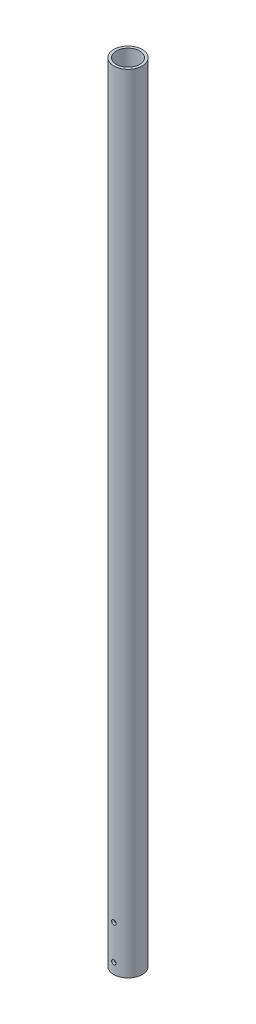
from build123d import *

# Parameters (mm, degrees)
SKETCH1_R               = 21.082
SKETCH1_R_2             = 17.272
BOSS_EXTRUDE1_DEPTH     = 1160.4625
F_1_4_CLEARANCE_HOLE1_D = 6.7564


with BuildPart() as part:
    # Sketch1 → Boss-Extrude1 (new body)
    with BuildSketch(Plane(origin=(0, 0, 0), x_dir=(1, 0, 0), z_dir=(0, 1, 0))):
        with Locations(Location((0, 0, 0), (0, 0, 270))):
            Circle(SKETCH1_R)
        with Locations(Location((0, 0, 0), (0, 0, 270))):
            Circle(SKETCH1_R_2, mode=Mode.SUBTRACT)
    extrude(amount=BOSS_EXTRUDE1_DEPTH)

    # 1_4 Clearance Hole1 (through all)
    with Locations(Plane.XY.offset(21.082)):
        with Locations((0, 15.875), (0, 66.675)):
            Hole(F_1_4_CLEARANCE_HOLE1_D / 2)


solid = part.part
